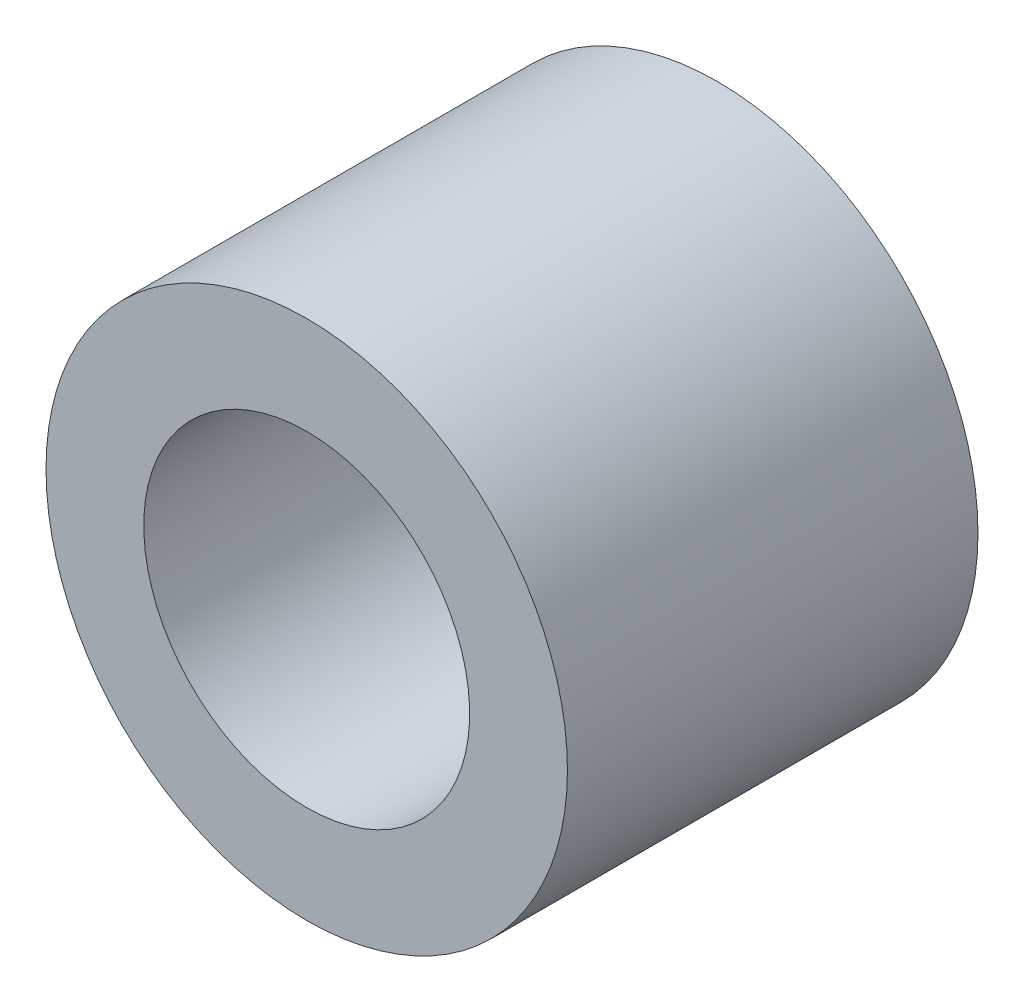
from build123d import *

# Parameters (mm, degrees)
SKETCH1_R           = 2.54
SKETCH1_R_2         = 1.5875
BOSS_EXTRUDE1_DEPTH = 3.99999962


with BuildPart() as part:
    # Sketch1 → Boss-Extrude1 (new body)
    with BuildSketch(Plane(origin=(0, 0, 116.221454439), x_dir=(-1, 0, 0), z_dir=(0, 0, -1))):
        with Locations(Location((0, 0, 0), (0, 0, 90))):
            Circle(SKETCH1_R)
        with Locations(Location((0, 0, 0), (0, 0, 90))):
            Circle(SKETCH1_R_2, mode=Mode.SUBTRACT)
    extrude(amount=BOSS_EXTRUDE1_DEPTH)


solid = part.part
